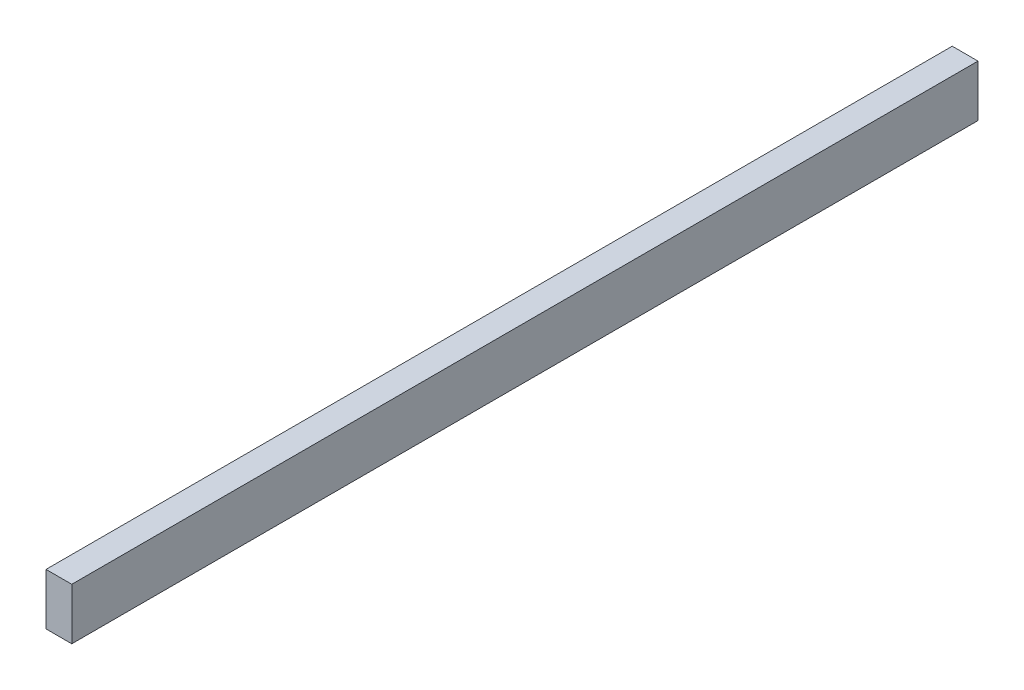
from build123d import *

# Parameters (mm, degrees)
ESQUISSE1_W      = 5
ESQUISSE1_H      = 10
EXTRUSION1_DEPTH = 175.77


with BuildPart() as part:
    # Esquisse1 → Extrusion1 (new body)
    with BuildSketch(Plane.XY):
        with Locations((2.5, 5)):
            Rectangle(ESQUISSE1_W, ESQUISSE1_H)
    extrude(amount=EXTRUSION1_DEPTH)


solid = part.part
